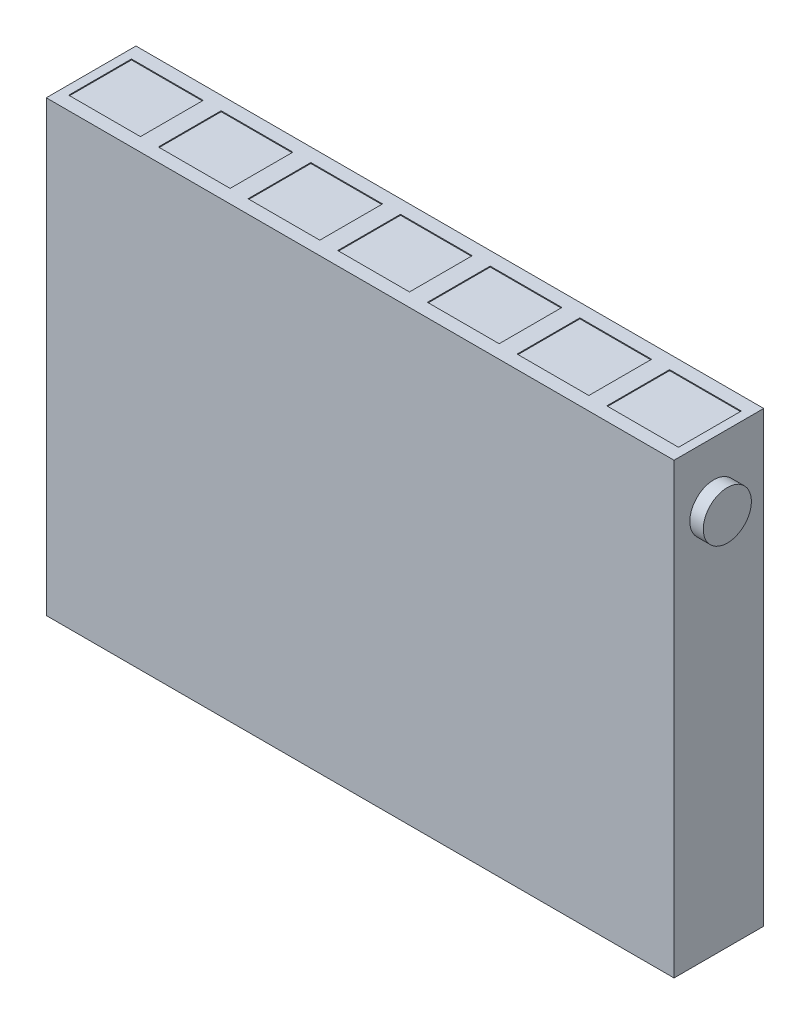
ISO-10303-21;
HEADER;
FILE_DESCRIPTION(('STEP AP214'),'2;1');
FILE_NAME('part.step','',(''),(''),'','','');
FILE_SCHEMA(('AUTOMOTIVE_DESIGN { 1 0 10303 214 1 1 1 1 }'));
ENDSEC;
DATA;
#1=APPLICATION_CONTEXT('core data for automotive mechanical design processes');
#2=APPLICATION_PROTOCOL_DEFINITION('international standard','automotive_design',2000,#1);
#3=PRODUCT_CONTEXT('',#1,'mechanical');
#4=PRODUCT('Part','Part','',(#3));
#5=PRODUCT_RELATED_PRODUCT_CATEGORY('part','',(#4));
#6=PRODUCT_DEFINITION_FORMATION('','',#4);
#7=PRODUCT_DEFINITION_CONTEXT('part definition',#1,'design');
#8=PRODUCT_DEFINITION('design','',#6,#7);
#9=PRODUCT_DEFINITION_SHAPE('','',#8);
#10=(LENGTH_UNIT() NAMED_UNIT(*) SI_UNIT(.MILLI.,.METRE.));
#11=(NAMED_UNIT(*) PLANE_ANGLE_UNIT() SI_UNIT($,.RADIAN.));
#12=(NAMED_UNIT(*) SI_UNIT($,.STERADIAN.) SOLID_ANGLE_UNIT());
#13=UNCERTAINTY_MEASURE_WITH_UNIT(LENGTH_MEASURE(1.E-05),#10,'distance_accuracy_value','');
#14=(GEOMETRIC_REPRESENTATION_CONTEXT(3) GLOBAL_UNCERTAINTY_ASSIGNED_CONTEXT((#13)) GLOBAL_UNIT_ASSIGNED_CONTEXT((#10,
#11,#12)) REPRESENTATION_CONTEXT('',''));
#15=CARTESIAN_POINT('',(0.,0.,0.));
#16=DIRECTION('',(0.,0.,1.));
#17=DIRECTION('',(1.,0.,0.));
#18=AXIS2_PLACEMENT_3D('',#15,#16,#17);
#19=CARTESIAN_POINT('',(-350.,-250.,100.));
#20=DIRECTION('',(1.,0.,0.));
#21=DIRECTION('',(0.,0.,-1.));
#22=AXIS2_PLACEMENT_3D('',#19,#20,#21);
#23=PLANE('',#22);
#24=DIRECTION('',(0.,-1.,0.));
#25=VECTOR('',#24,1.);
#26=CARTESIAN_POINT('',(-350.,-250.,0.));
#27=LINE('',#26,#25);
#28=CARTESIAN_POINT('',(-350.,250.,0.));
#29=VERTEX_POINT('',#28);
#30=CARTESIAN_POINT('',(-350.,-250.,0.));
#31=VERTEX_POINT('',#30);
#32=EDGE_CURVE('E474',#29,#31,#27,.T.);
#33=ORIENTED_EDGE('',*,*,#32,.T.);
#34=DIRECTION('',(0.,0.,-1.));
#35=VECTOR('',#34,1.);
#36=CARTESIAN_POINT('',(-350.,-250.,100.));
#37=LINE('',#36,#35);
#38=CARTESIAN_POINT('',(-350.,-250.,100.));
#39=VERTEX_POINT('',#38);
#40=EDGE_CURVE('E42',#39,#31,#37,.T.);
#41=ORIENTED_EDGE('',*,*,#40,.F.);
#42=DIRECTION('',(0.,-1.,0.));
#43=VECTOR('',#42,1.);
#44=CARTESIAN_POINT('',(-350.,-250.,100.));
#45=LINE('',#44,#43);
#46=CARTESIAN_POINT('',(-350.,250.,100.));
#47=VERTEX_POINT('',#46);
#48=EDGE_CURVE('E475',#47,#39,#45,.T.);
#49=ORIENTED_EDGE('',*,*,#48,.F.);
#50=DIRECTION('',(0.,0.,-1.));
#51=VECTOR('',#50,1.);
#52=CARTESIAN_POINT('',(-350.,250.,100.));
#53=LINE('',#52,#51);
#54=EDGE_CURVE('E485',#47,#29,#53,.T.);
#55=ORIENTED_EDGE('',*,*,#54,.T.);
#56=EDGE_LOOP('',(#33,#41,#49,#55));
#57=FACE_BOUND('',#56,.T.);
#58=ADVANCED_FACE('F35',(#57),#23,.F.);
#59=CARTESIAN_POINT('',(350.,-250.,100.));
#60=DIRECTION('',(0.,1.,0.));
#61=DIRECTION('',(-1.,0.,0.));
#62=AXIS2_PLACEMENT_3D('',#59,#60,#61);
#63=PLANE('',#62);
#64=DIRECTION('',(1.,0.,0.));
#65=VECTOR('',#64,1.);
#66=CARTESIAN_POINT('',(350.,-250.,0.));
#67=LINE('',#66,#65);
#68=CARTESIAN_POINT('',(350.,-250.,0.));
#69=VERTEX_POINT('',#68);
#70=EDGE_CURVE('E488',#31,#69,#67,.T.);
#71=ORIENTED_EDGE('',*,*,#70,.T.);
#72=DIRECTION('',(0.,0.,-1.));
#73=VECTOR('',#72,1.);
#74=CARTESIAN_POINT('',(350.,-250.,100.));
#75=LINE('',#74,#73);
#76=CARTESIAN_POINT('',(350.,-250.,100.));
#77=VERTEX_POINT('',#76);
#78=EDGE_CURVE('E498',#77,#69,#75,.T.);
#79=ORIENTED_EDGE('',*,*,#78,.F.);
#80=DIRECTION('',(1.,0.,0.));
#81=VECTOR('',#80,1.);
#82=CARTESIAN_POINT('',(350.,-250.,100.));
#83=LINE('',#82,#81);
#84=EDGE_CURVE('E478',#39,#77,#83,.T.);
#85=ORIENTED_EDGE('',*,*,#84,.F.);
#86=ORIENTED_EDGE('',*,*,#40,.T.);
#87=EDGE_LOOP('',(#71,#79,#85,#86));
#88=FACE_BOUND('',#87,.T.);
#89=ADVANCED_FACE('F503',(#88),#63,.F.);
#90=CARTESIAN_POINT('',(350.,-250.,100.));
#91=DIRECTION('',(-1.,0.,0.));
#92=DIRECTION('',(0.,0.,1.));
#93=AXIS2_PLACEMENT_3D('',#90,#91,#92);
#94=PLANE('',#93);
#95=CARTESIAN_POINT('',(350.,182.141362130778,55.5846904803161));
#96=DIRECTION('',(-1.,0.,0.));
#97=DIRECTION('',(0.,0.,1.));
#98=AXIS2_PLACEMENT_3D('',#95,#96,#97);
#99=CIRCLE('',#98,26.8213337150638);
#100=CARTESIAN_POINT('',(350.,182.141362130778,82.40602419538));
#101=VERTEX_POINT('',#100);
#102=EDGE_CURVE('E11',#101,#101,#99,.F.);
#103=ORIENTED_EDGE('',*,*,#102,.F.);
#104=EDGE_LOOP('',(#103));
#105=FACE_BOUND('',#104,.T.);
#106=DIRECTION('',(0.,1.,0.));
#107=VECTOR('',#106,1.);
#108=CARTESIAN_POINT('',(350.,-250.,0.));
#109=LINE('',#108,#107);
#110=CARTESIAN_POINT('',(350.,250.,0.));
#111=VERTEX_POINT('',#110);
#112=EDGE_CURVE('E490',#69,#111,#109,.T.);
#113=ORIENTED_EDGE('',*,*,#112,.T.);
#114=DIRECTION('',(0.,0.,-1.));
#115=VECTOR('',#114,1.);
#116=CARTESIAN_POINT('',(350.,250.,100.));
#117=LINE('',#116,#115);
#118=CARTESIAN_POINT('',(350.,250.,100.));
#119=VERTEX_POINT('',#118);
#120=EDGE_CURVE('E495',#119,#111,#117,.T.);
#121=ORIENTED_EDGE('',*,*,#120,.F.);
#122=DIRECTION('',(0.,1.,0.));
#123=VECTOR('',#122,1.);
#124=CARTESIAN_POINT('',(350.,-250.,100.));
#125=LINE('',#124,#123);
#126=EDGE_CURVE('E481',#77,#119,#125,.T.);
#127=ORIENTED_EDGE('',*,*,#126,.F.);
#128=ORIENTED_EDGE('',*,*,#78,.T.);
#129=EDGE_LOOP('',(#113,#121,#127,#128));
#130=FACE_BOUND('',#129,.T.);
#131=ADVANCED_FACE('F515',(#105,#130),#94,.F.);
#132=CARTESIAN_POINT('',(350.,250.,100.));
#133=DIRECTION('',(0.,-1.,0.));
#134=DIRECTION('',(1.,0.,0.));
#135=AXIS2_PLACEMENT_3D('',#132,#133,#134);
#136=PLANE('',#135);
#137=DIRECTION('',(1.,0.,0.));
#138=VECTOR('',#137,1.);
#139=CARTESIAN_POINT('',(260.,250.,85.));
#140=LINE('',#139,#138);
#141=CARTESIAN_POINT('',(260.,250.,85.));
#142=VERTEX_POINT('',#141);
#143=CARTESIAN_POINT('',(340.,250.,85.));
#144=VERTEX_POINT('',#143);
#145=EDGE_CURVE('E272',#142,#144,#140,.T.);
#146=ORIENTED_EDGE('',*,*,#145,.F.);
#147=DIRECTION('',(0.,0.,1.));
#148=VECTOR('',#147,1.);
#149=CARTESIAN_POINT('',(260.,250.,15.));
#150=LINE('',#149,#148);
#151=CARTESIAN_POINT('',(260.,250.,15.));
#152=VERTEX_POINT('',#151);
#153=EDGE_CURVE('E49',#152,#142,#150,.T.);
#154=ORIENTED_EDGE('',*,*,#153,.F.);
#155=DIRECTION('',(-1.,0.,0.));
#156=VECTOR('',#155,1.);
#157=CARTESIAN_POINT('',(260.,250.,15.));
#158=LINE('',#157,#156);
#159=CARTESIAN_POINT('',(340.,250.,15.));
#160=VERTEX_POINT('',#159);
#161=EDGE_CURVE('E263',#160,#152,#158,.T.);
#162=ORIENTED_EDGE('',*,*,#161,.F.);
#163=DIRECTION('',(0.,0.,-1.));
#164=VECTOR('',#163,1.);
#165=CARTESIAN_POINT('',(340.,250.,15.));
#166=LINE('',#165,#164);
#167=EDGE_CURVE('E266',#144,#160,#166,.T.);
#168=ORIENTED_EDGE('',*,*,#167,.F.);
#169=EDGE_LOOP('',(#146,#154,#162,#168));
#170=FACE_BOUND('',#169,.T.);
#171=DIRECTION('',(1.,0.,0.));
#172=VECTOR('',#171,1.);
#173=CARTESIAN_POINT('',(160.,250.,85.));
#174=LINE('',#173,#172);
#175=CARTESIAN_POINT('',(160.,250.,85.));
#176=VERTEX_POINT('',#175);
#177=CARTESIAN_POINT('',(240.,250.,85.));
#178=VERTEX_POINT('',#177);
#179=EDGE_CURVE('E296',#176,#178,#174,.T.);
#180=ORIENTED_EDGE('',*,*,#179,.F.);
#181=DIRECTION('',(0.,0.,1.));
#182=VECTOR('',#181,1.);
#183=CARTESIAN_POINT('',(160.,250.,15.));
#184=LINE('',#183,#182);
#185=CARTESIAN_POINT('',(160.,250.,15.));
#186=VERTEX_POINT('',#185);
#187=EDGE_CURVE('E57',#186,#176,#184,.T.);
#188=ORIENTED_EDGE('',*,*,#187,.F.);
#189=DIRECTION('',(-1.,0.,0.));
#190=VECTOR('',#189,1.);
#191=CARTESIAN_POINT('',(160.,250.,15.));
#192=LINE('',#191,#190);
#193=CARTESIAN_POINT('',(240.,250.,15.));
#194=VERTEX_POINT('',#193);
#195=EDGE_CURVE('E285',#194,#186,#192,.T.);
#196=ORIENTED_EDGE('',*,*,#195,.F.);
#197=DIRECTION('',(0.,0.,-1.));
#198=VECTOR('',#197,1.);
#199=CARTESIAN_POINT('',(240.,250.,15.));
#200=LINE('',#199,#198);
#201=EDGE_CURVE('E299',#178,#194,#200,.T.);
#202=ORIENTED_EDGE('',*,*,#201,.F.);
#203=EDGE_LOOP('',(#180,#188,#196,#202));
#204=FACE_BOUND('',#203,.T.);
#205=DIRECTION('',(1.,0.,0.));
#206=VECTOR('',#205,1.);
#207=CARTESIAN_POINT('',(60.,250.,85.));
#208=LINE('',#207,#206);
#209=CARTESIAN_POINT('',(59.9999999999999,250.,85.));
#210=VERTEX_POINT('',#209);
#211=CARTESIAN_POINT('',(140.,250.,85.));
#212=VERTEX_POINT('',#211);
#213=EDGE_CURVE('E327',#210,#212,#208,.T.);
#214=ORIENTED_EDGE('',*,*,#213,.F.);
#215=DIRECTION('',(0.,0.,1.));
#216=VECTOR('',#215,1.);
#217=CARTESIAN_POINT('',(60.,250.,15.));
#218=LINE('',#217,#216);
#219=CARTESIAN_POINT('',(60.,250.,15.));
#220=VERTEX_POINT('',#219);
#221=EDGE_CURVE('E306',#220,#210,#218,.T.);
#222=ORIENTED_EDGE('',*,*,#221,.F.);
#223=DIRECTION('',(-1.,0.,0.));
#224=VECTOR('',#223,1.);
#225=CARTESIAN_POINT('',(60.,250.,15.));
#226=LINE('',#225,#224);
#227=CARTESIAN_POINT('',(140.,250.,15.));
#228=VERTEX_POINT('',#227);
#229=EDGE_CURVE('E316',#228,#220,#226,.T.);
#230=ORIENTED_EDGE('',*,*,#229,.F.);
#231=DIRECTION('',(0.,0.,-1.));
#232=VECTOR('',#231,1.);
#233=CARTESIAN_POINT('',(140.,250.,15.));
#234=LINE('',#233,#232);
#235=EDGE_CURVE('E330',#212,#228,#234,.T.);
#236=ORIENTED_EDGE('',*,*,#235,.F.);
#237=EDGE_LOOP('',(#214,#222,#230,#236));
#238=FACE_BOUND('',#237,.T.);
#239=DIRECTION('',(1.,0.,0.));
#240=VECTOR('',#239,1.);
#241=CARTESIAN_POINT('',(-40.,250.,85.));
#242=LINE('',#241,#240);
#243=CARTESIAN_POINT('',(-40.,250.,85.));
#244=VERTEX_POINT('',#243);
#245=CARTESIAN_POINT('',(40.,250.,85.));
#246=VERTEX_POINT('',#245);
#247=EDGE_CURVE('E359',#244,#246,#242,.T.);
#248=ORIENTED_EDGE('',*,*,#247,.F.);
#249=DIRECTION('',(0.,0.,1.));
#250=VECTOR('',#249,1.);
#251=CARTESIAN_POINT('',(-40.,250.,15.));
#252=LINE('',#251,#250);
#253=CARTESIAN_POINT('',(-40.,250.,15.));
#254=VERTEX_POINT('',#253);
#255=EDGE_CURVE('E337',#254,#244,#252,.T.);
#256=ORIENTED_EDGE('',*,*,#255,.F.);
#257=DIRECTION('',(-1.,0.,0.));
#258=VECTOR('',#257,1.);
#259=CARTESIAN_POINT('',(-40.,250.,15.));
#260=LINE('',#259,#258);
#261=CARTESIAN_POINT('',(40.,250.,15.));
#262=VERTEX_POINT('',#261);
#263=EDGE_CURVE('E348',#262,#254,#260,.T.);
#264=ORIENTED_EDGE('',*,*,#263,.F.);
#265=DIRECTION('',(0.,0.,-1.));
#266=VECTOR('',#265,1.);
#267=CARTESIAN_POINT('',(40.,250.,15.));
#268=LINE('',#267,#266);
#269=EDGE_CURVE('E362',#246,#262,#268,.T.);
#270=ORIENTED_EDGE('',*,*,#269,.F.);
#271=EDGE_LOOP('',(#248,#256,#264,#270));
#272=FACE_BOUND('',#271,.T.);
#273=DIRECTION('',(1.,0.,0.));
#274=VECTOR('',#273,1.);
#275=CARTESIAN_POINT('',(-140.,250.,85.));
#276=LINE('',#275,#274);
#277=CARTESIAN_POINT('',(-140.,250.,85.));
#278=VERTEX_POINT('',#277);
#279=CARTESIAN_POINT('',(-60.,250.,85.));
#280=VERTEX_POINT('',#279);
#281=EDGE_CURVE('E391',#278,#280,#276,.T.);
#282=ORIENTED_EDGE('',*,*,#281,.F.);
#283=DIRECTION('',(0.,0.,1.));
#284=VECTOR('',#283,1.);
#285=CARTESIAN_POINT('',(-140.,250.,15.));
#286=LINE('',#285,#284);
#287=CARTESIAN_POINT('',(-140.,250.,15.));
#288=VERTEX_POINT('',#287);
#289=EDGE_CURVE('E369',#288,#278,#286,.T.);
#290=ORIENTED_EDGE('',*,*,#289,.F.);
#291=DIRECTION('',(-1.,0.,0.));
#292=VECTOR('',#291,1.);
#293=CARTESIAN_POINT('',(-140.,250.,15.));
#294=LINE('',#293,#292);
#295=CARTESIAN_POINT('',(-60.,250.,15.));
#296=VERTEX_POINT('',#295);
#297=EDGE_CURVE('E380',#296,#288,#294,.T.);
#298=ORIENTED_EDGE('',*,*,#297,.F.);
#299=DIRECTION('',(0.,0.,-1.));
#300=VECTOR('',#299,1.);
#301=CARTESIAN_POINT('',(-60.,250.,15.));
#302=LINE('',#301,#300);
#303=EDGE_CURVE('E394',#280,#296,#302,.T.);
#304=ORIENTED_EDGE('',*,*,#303,.F.);
#305=EDGE_LOOP('',(#282,#290,#298,#304));
#306=FACE_BOUND('',#305,.T.);
#307=DIRECTION('',(1.,0.,0.));
#308=VECTOR('',#307,1.);
#309=CARTESIAN_POINT('',(-240.,250.,85.));
#310=LINE('',#309,#308);
#311=CARTESIAN_POINT('',(-240.,250.,85.));
#312=VERTEX_POINT('',#311);
#313=CARTESIAN_POINT('',(-160.,250.,85.));
#314=VERTEX_POINT('',#313);
#315=EDGE_CURVE('E423',#312,#314,#310,.T.);
#316=ORIENTED_EDGE('',*,*,#315,.F.);
#317=DIRECTION('',(0.,0.,1.));
#318=VECTOR('',#317,1.);
#319=CARTESIAN_POINT('',(-240.,250.,15.));
#320=LINE('',#319,#318);
#321=CARTESIAN_POINT('',(-240.,250.,15.));
#322=VERTEX_POINT('',#321);
#323=EDGE_CURVE('E401',#322,#312,#320,.T.);
#324=ORIENTED_EDGE('',*,*,#323,.F.);
#325=DIRECTION('',(-1.,0.,0.));
#326=VECTOR('',#325,1.);
#327=CARTESIAN_POINT('',(-240.,250.,15.));
#328=LINE('',#327,#326);
#329=CARTESIAN_POINT('',(-160.,250.,15.));
#330=VERTEX_POINT('',#329);
#331=EDGE_CURVE('E412',#330,#322,#328,.T.);
#332=ORIENTED_EDGE('',*,*,#331,.F.);
#333=DIRECTION('',(0.,0.,-1.));
#334=VECTOR('',#333,1.);
#335=CARTESIAN_POINT('',(-160.,250.,15.));
#336=LINE('',#335,#334);
#337=EDGE_CURVE('E426',#314,#330,#336,.T.);
#338=ORIENTED_EDGE('',*,*,#337,.F.);
#339=EDGE_LOOP('',(#316,#324,#332,#338));
#340=FACE_BOUND('',#339,.T.);
#341=DIRECTION('',(1.,0.,0.));
#342=VECTOR('',#341,1.);
#343=CARTESIAN_POINT('',(-340.,250.,85.));
#344=LINE('',#343,#342);
#345=CARTESIAN_POINT('',(-340.,250.,85.));
#346=VERTEX_POINT('',#345);
#347=CARTESIAN_POINT('',(-260.,250.,85.));
#348=VERTEX_POINT('',#347);
#349=EDGE_CURVE('E455',#346,#348,#344,.T.);
#350=ORIENTED_EDGE('',*,*,#349,.F.);
#351=DIRECTION('',(0.,0.,1.));
#352=VECTOR('',#351,1.);
#353=CARTESIAN_POINT('',(-340.,250.,15.));
#354=LINE('',#353,#352);
#355=CARTESIAN_POINT('',(-340.,250.,15.));
#356=VERTEX_POINT('',#355);
#357=EDGE_CURVE('E433',#356,#346,#354,.T.);
#358=ORIENTED_EDGE('',*,*,#357,.F.);
#359=DIRECTION('',(-1.,0.,0.));
#360=VECTOR('',#359,1.);
#361=CARTESIAN_POINT('',(-340.,250.,15.));
#362=LINE('',#361,#360);
#363=CARTESIAN_POINT('',(-260.,250.,15.));
#364=VERTEX_POINT('',#363);
#365=EDGE_CURVE('E444',#364,#356,#362,.T.);
#366=ORIENTED_EDGE('',*,*,#365,.F.);
#367=DIRECTION('',(0.,0.,-1.));
#368=VECTOR('',#367,1.);
#369=CARTESIAN_POINT('',(-260.,250.,15.));
#370=LINE('',#369,#368);
#371=EDGE_CURVE('E458',#348,#364,#370,.T.);
#372=ORIENTED_EDGE('',*,*,#371,.F.);
#373=EDGE_LOOP('',(#350,#358,#366,#372));
#374=FACE_BOUND('',#373,.T.);
#375=DIRECTION('',(-1.,0.,0.));
#376=VECTOR('',#375,1.);
#377=CARTESIAN_POINT('',(350.,250.,0.));
#378=LINE('',#377,#376);
#379=EDGE_CURVE('E479',#111,#29,#378,.T.);
#380=ORIENTED_EDGE('',*,*,#379,.T.);
#381=ORIENTED_EDGE('',*,*,#54,.F.);
#382=DIRECTION('',(-1.,0.,0.));
#383=VECTOR('',#382,1.);
#384=CARTESIAN_POINT('',(350.,250.,100.));
#385=LINE('',#384,#383);
#386=EDGE_CURVE('E483',#119,#47,#385,.T.);
#387=ORIENTED_EDGE('',*,*,#386,.F.);
#388=ORIENTED_EDGE('',*,*,#120,.T.);
#389=EDGE_LOOP('',(#380,#381,#387,#388));
#390=FACE_BOUND('',#389,.T.);
#391=ADVANCED_FACE('F519',(#170,#204,#238,#272,#306,#340,#374,#390),#136,.F.);
#392=CARTESIAN_POINT('',(0.,0.,100.));
#393=DIRECTION('',(0.,0.,1.));
#394=DIRECTION('',(1.,0.,0.));
#395=AXIS2_PLACEMENT_3D('',#392,#393,#394);
#396=PLANE('',#395);
#397=ORIENTED_EDGE('',*,*,#48,.T.);
#398=ORIENTED_EDGE('',*,*,#84,.T.);
#399=ORIENTED_EDGE('',*,*,#126,.T.);
#400=ORIENTED_EDGE('',*,*,#386,.T.);
#401=EDGE_LOOP('',(#397,#398,#399,#400));
#402=FACE_BOUND('',#401,.T.);
#403=ADVANCED_FACE('F521',(#402),#396,.T.);
#404=CARTESIAN_POINT('',(0.,0.,0.));
#405=DIRECTION('',(0.,0.,1.));
#406=DIRECTION('',(1.,0.,0.));
#407=AXIS2_PLACEMENT_3D('',#404,#405,#406);
#408=PLANE('',#407);
#409=ORIENTED_EDGE('',*,*,#32,.F.);
#410=ORIENTED_EDGE('',*,*,#379,.F.);
#411=ORIENTED_EDGE('',*,*,#112,.F.);
#412=ORIENTED_EDGE('',*,*,#70,.F.);
#413=EDGE_LOOP('',(#409,#410,#411,#412));
#414=FACE_BOUND('',#413,.T.);
#415=ADVANCED_FACE('F511',(#414),#408,.F.);
#416=CARTESIAN_POINT('',(365.,182.141362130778,55.5846904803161));
#417=DIRECTION('',(-1.,0.,0.));
#418=DIRECTION('',(0.,0.,1.));
#419=AXIS2_PLACEMENT_3D('',#416,#417,#418);
#420=CYLINDRICAL_SURFACE('',#419,26.8213337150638);
#421=CARTESIAN_POINT('',(365.,182.141362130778,55.5846904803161));
#422=DIRECTION('',(1.,0.,0.));
#423=DIRECTION('',(0.,0.,-1.));
#424=AXIS2_PLACEMENT_3D('',#421,#422,#423);
#425=CIRCLE('',#424,26.8213337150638);
#426=CARTESIAN_POINT('',(365.,182.141362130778,28.7633567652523));
#427=VERTEX_POINT('',#426);
#428=EDGE_CURVE('E465',#427,#427,#425,.T.);
#429=ORIENTED_EDGE('',*,*,#428,.F.);
#430=EDGE_LOOP('',(#429));
#431=FACE_BOUND('',#430,.T.);
#432=ORIENTED_EDGE('',*,*,#102,.T.);
#433=EDGE_LOOP('',(#432));
#434=FACE_BOUND('',#433,.T.);
#435=ADVANCED_FACE('F528',(#431,#434),#420,.T.);
#436=CARTESIAN_POINT('',(365.,182.141362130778,55.5846904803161));
#437=DIRECTION('',(1.,0.,0.));
#438=DIRECTION('',(0.,0.,-1.));
#439=AXIS2_PLACEMENT_3D('',#436,#437,#438);
#440=PLANE('',#439);
#441=ORIENTED_EDGE('',*,*,#428,.T.);
#442=EDGE_LOOP('',(#441));
#443=FACE_BOUND('',#442,.T.);
#444=ADVANCED_FACE('F547',(#443),#440,.T.);
#445=CARTESIAN_POINT('',(-340.,249.,15.));
#446=DIRECTION('',(-1.,0.,0.));
#447=DIRECTION('',(0.,-1.,0.));
#448=AXIS2_PLACEMENT_3D('',#445,#446,#447);
#449=PLANE('',#448);
#450=ORIENTED_EDGE('',*,*,#357,.T.);
#451=DIRECTION('',(0.,1.,0.));
#452=VECTOR('',#451,1.);
#453=CARTESIAN_POINT('',(-340.,249.,85.));
#454=LINE('',#453,#452);
#455=CARTESIAN_POINT('',(-340.,249.,85.));
#456=VERTEX_POINT('',#455);
#457=EDGE_CURVE('E453',#456,#346,#454,.T.);
#458=ORIENTED_EDGE('',*,*,#457,.F.);
#459=DIRECTION('',(0.,0.,1.));
#460=VECTOR('',#459,1.);
#461=CARTESIAN_POINT('',(-340.,249.,15.));
#462=LINE('',#461,#460);
#463=CARTESIAN_POINT('',(-340.,249.,15.));
#464=VERTEX_POINT('',#463);
#465=EDGE_CURVE('E440',#464,#456,#462,.T.);
#466=ORIENTED_EDGE('',*,*,#465,.F.);
#467=DIRECTION('',(0.,1.,0.));
#468=VECTOR('',#467,1.);
#469=CARTESIAN_POINT('',(-340.,249.,15.));
#470=LINE('',#469,#468);
#471=EDGE_CURVE('E463',#464,#356,#470,.T.);
#472=ORIENTED_EDGE('',*,*,#471,.T.);
#473=EDGE_LOOP('',(#450,#458,#466,#472));
#474=FACE_BOUND('',#473,.T.);
#475=ADVANCED_FACE('F552',(#474),#449,.F.);
#476=CARTESIAN_POINT('',(-340.,249.,15.));
#477=DIRECTION('',(0.,0.,-1.));
#478=DIRECTION('',(-1.,0.,0.));
#479=AXIS2_PLACEMENT_3D('',#476,#477,#478);
#480=PLANE('',#479);
#481=ORIENTED_EDGE('',*,*,#365,.T.);
#482=ORIENTED_EDGE('',*,*,#471,.F.);
#483=DIRECTION('',(-1.,0.,0.));
#484=VECTOR('',#483,1.);
#485=CARTESIAN_POINT('',(-340.,249.,15.));
#486=LINE('',#485,#484);
#487=CARTESIAN_POINT('',(-260.,249.,15.));
#488=VERTEX_POINT('',#487);
#489=EDGE_CURVE('E450',#488,#464,#486,.T.);
#490=ORIENTED_EDGE('',*,*,#489,.F.);
#491=DIRECTION('',(0.,1.,0.));
#492=VECTOR('',#491,1.);
#493=CARTESIAN_POINT('',(-260.,249.,15.));
#494=LINE('',#493,#492);
#495=EDGE_CURVE('E466',#488,#364,#494,.T.);
#496=ORIENTED_EDGE('',*,*,#495,.T.);
#497=EDGE_LOOP('',(#481,#482,#490,#496));
#498=FACE_BOUND('',#497,.T.);
#499=ADVANCED_FACE('F559',(#498),#480,.F.);
#500=CARTESIAN_POINT('',(-260.,249.,15.));
#501=DIRECTION('',(1.,0.,0.));
#502=DIRECTION('',(0.,1.,0.));
#503=AXIS2_PLACEMENT_3D('',#500,#501,#502);
#504=PLANE('',#503);
#505=ORIENTED_EDGE('',*,*,#371,.T.);
#506=ORIENTED_EDGE('',*,*,#495,.F.);
#507=DIRECTION('',(0.,0.,-1.));
#508=VECTOR('',#507,1.);
#509=CARTESIAN_POINT('',(-260.,249.,15.));
#510=LINE('',#509,#508);
#511=CARTESIAN_POINT('',(-260.,249.,85.));
#512=VERTEX_POINT('',#511);
#513=EDGE_CURVE('E447',#512,#488,#510,.T.);
#514=ORIENTED_EDGE('',*,*,#513,.F.);
#515=DIRECTION('',(0.,1.,0.));
#516=VECTOR('',#515,1.);
#517=CARTESIAN_POINT('',(-260.,249.,85.));
#518=LINE('',#517,#516);
#519=EDGE_CURVE('E468',#512,#348,#518,.T.);
#520=ORIENTED_EDGE('',*,*,#519,.T.);
#521=EDGE_LOOP('',(#505,#506,#514,#520));
#522=FACE_BOUND('',#521,.T.);
#523=ADVANCED_FACE('F565',(#522),#504,.F.);
#524=CARTESIAN_POINT('',(-340.,249.,85.));
#525=DIRECTION('',(0.,0.,1.));
#526=DIRECTION('',(1.,0.,0.));
#527=AXIS2_PLACEMENT_3D('',#524,#525,#526);
#528=PLANE('',#527);
#529=ORIENTED_EDGE('',*,*,#349,.T.);
#530=ORIENTED_EDGE('',*,*,#519,.F.);
#531=DIRECTION('',(1.,0.,0.));
#532=VECTOR('',#531,1.);
#533=CARTESIAN_POINT('',(-340.,249.,85.));
#534=LINE('',#533,#532);
#535=EDGE_CURVE('E443',#456,#512,#534,.T.);
#536=ORIENTED_EDGE('',*,*,#535,.F.);
#537=ORIENTED_EDGE('',*,*,#457,.T.);
#538=EDGE_LOOP('',(#529,#530,#536,#537));
#539=FACE_BOUND('',#538,.T.);
#540=ADVANCED_FACE('F561',(#539),#528,.F.);
#541=CARTESIAN_POINT('',(0.,249.,0.));
#542=DIRECTION('',(0.,1.,0.));
#543=DIRECTION('',(-1.,0.,0.));
#544=AXIS2_PLACEMENT_3D('',#541,#542,#543);
#545=PLANE('',#544);
#546=ORIENTED_EDGE('',*,*,#465,.T.);
#547=ORIENTED_EDGE('',*,*,#535,.T.);
#548=ORIENTED_EDGE('',*,*,#513,.T.);
#549=ORIENTED_EDGE('',*,*,#489,.T.);
#550=EDGE_LOOP('',(#546,#547,#548,#549));
#551=FACE_BOUND('',#550,.T.);
#552=ADVANCED_FACE('F564',(#551),#545,.T.);
#553=CARTESIAN_POINT('',(-240.,249.,15.));
#554=DIRECTION('',(-1.,0.,0.));
#555=DIRECTION('',(0.,-1.,0.));
#556=AXIS2_PLACEMENT_3D('',#553,#554,#555);
#557=PLANE('',#556);
#558=ORIENTED_EDGE('',*,*,#323,.T.);
#559=DIRECTION('',(0.,1.,0.));
#560=VECTOR('',#559,1.);
#561=CARTESIAN_POINT('',(-240.,249.,85.));
#562=LINE('',#561,#560);
#563=CARTESIAN_POINT('',(-240.,249.,85.));
#564=VERTEX_POINT('',#563);
#565=EDGE_CURVE('E421',#564,#312,#562,.T.);
#566=ORIENTED_EDGE('',*,*,#565,.F.);
#567=DIRECTION('',(0.,0.,1.));
#568=VECTOR('',#567,1.);
#569=CARTESIAN_POINT('',(-240.,249.,15.));
#570=LINE('',#569,#568);
#571=CARTESIAN_POINT('',(-240.,249.,15.));
#572=VERTEX_POINT('',#571);
#573=EDGE_CURVE('E408',#572,#564,#570,.T.);
#574=ORIENTED_EDGE('',*,*,#573,.F.);
#575=DIRECTION('',(0.,1.,0.));
#576=VECTOR('',#575,1.);
#577=CARTESIAN_POINT('',(-240.,249.,15.));
#578=LINE('',#577,#576);
#579=EDGE_CURVE('E431',#572,#322,#578,.T.);
#580=ORIENTED_EDGE('',*,*,#579,.T.);
#581=EDGE_LOOP('',(#558,#566,#574,#580));
#582=FACE_BOUND('',#581,.T.);
#583=ADVANCED_FACE('F575',(#582),#557,.F.);
#584=CARTESIAN_POINT('',(-240.,249.,15.));
#585=DIRECTION('',(0.,0.,-1.));
#586=DIRECTION('',(-1.,0.,0.));
#587=AXIS2_PLACEMENT_3D('',#584,#585,#586);
#588=PLANE('',#587);
#589=ORIENTED_EDGE('',*,*,#331,.T.);
#590=ORIENTED_EDGE('',*,*,#579,.F.);
#591=DIRECTION('',(-1.,0.,0.));
#592=VECTOR('',#591,1.);
#593=CARTESIAN_POINT('',(-240.,249.,15.));
#594=LINE('',#593,#592);
#595=CARTESIAN_POINT('',(-160.,249.,15.));
#596=VERTEX_POINT('',#595);
#597=EDGE_CURVE('E418',#596,#572,#594,.T.);
#598=ORIENTED_EDGE('',*,*,#597,.F.);
#599=DIRECTION('',(0.,1.,0.));
#600=VECTOR('',#599,1.);
#601=CARTESIAN_POINT('',(-160.,249.,15.));
#602=LINE('',#601,#600);
#603=EDGE_CURVE('E434',#596,#330,#602,.T.);
#604=ORIENTED_EDGE('',*,*,#603,.T.);
#605=EDGE_LOOP('',(#589,#590,#598,#604));
#606=FACE_BOUND('',#605,.T.);
#607=ADVANCED_FACE('F579',(#606),#588,.F.);
#608=CARTESIAN_POINT('',(-160.,249.,15.));
#609=DIRECTION('',(1.,0.,0.));
#610=DIRECTION('',(0.,1.,0.));
#611=AXIS2_PLACEMENT_3D('',#608,#609,#610);
#612=PLANE('',#611);
#613=ORIENTED_EDGE('',*,*,#337,.T.);
#614=ORIENTED_EDGE('',*,*,#603,.F.);
#615=DIRECTION('',(0.,0.,-1.));
#616=VECTOR('',#615,1.);
#617=CARTESIAN_POINT('',(-160.,249.,15.));
#618=LINE('',#617,#616);
#619=CARTESIAN_POINT('',(-160.,249.,85.));
#620=VERTEX_POINT('',#619);
#621=EDGE_CURVE('E415',#620,#596,#618,.T.);
#622=ORIENTED_EDGE('',*,*,#621,.F.);
#623=DIRECTION('',(0.,1.,0.));
#624=VECTOR('',#623,1.);
#625=CARTESIAN_POINT('',(-160.,249.,85.));
#626=LINE('',#625,#624);
#627=EDGE_CURVE('E436',#620,#314,#626,.T.);
#628=ORIENTED_EDGE('',*,*,#627,.T.);
#629=EDGE_LOOP('',(#613,#614,#622,#628));
#630=FACE_BOUND('',#629,.T.);
#631=ADVANCED_FACE('F585',(#630),#612,.F.);
#632=CARTESIAN_POINT('',(-240.,249.,85.));
#633=DIRECTION('',(0.,0.,1.));
#634=DIRECTION('',(1.,0.,0.));
#635=AXIS2_PLACEMENT_3D('',#632,#633,#634);
#636=PLANE('',#635);
#637=ORIENTED_EDGE('',*,*,#315,.T.);
#638=ORIENTED_EDGE('',*,*,#627,.F.);
#639=DIRECTION('',(1.,0.,0.));
#640=VECTOR('',#639,1.);
#641=CARTESIAN_POINT('',(-240.,249.,85.));
#642=LINE('',#641,#640);
#643=EDGE_CURVE('E411',#564,#620,#642,.T.);
#644=ORIENTED_EDGE('',*,*,#643,.F.);
#645=ORIENTED_EDGE('',*,*,#565,.T.);
#646=EDGE_LOOP('',(#637,#638,#644,#645));
#647=FACE_BOUND('',#646,.T.);
#648=ADVANCED_FACE('F581',(#647),#636,.F.);
#649=CARTESIAN_POINT('',(0.,249.,0.));
#650=DIRECTION('',(0.,1.,0.));
#651=DIRECTION('',(0.,0.,1.));
#652=AXIS2_PLACEMENT_3D('',#649,#650,#651);
#653=PLANE('',#652);
#654=ORIENTED_EDGE('',*,*,#573,.T.);
#655=ORIENTED_EDGE('',*,*,#643,.T.);
#656=ORIENTED_EDGE('',*,*,#621,.T.);
#657=ORIENTED_EDGE('',*,*,#597,.T.);
#658=EDGE_LOOP('',(#654,#655,#656,#657));
#659=FACE_BOUND('',#658,.T.);
#660=ADVANCED_FACE('F584',(#659),#653,.T.);
#661=CARTESIAN_POINT('',(-140.,249.,15.));
#662=DIRECTION('',(-1.,0.,0.));
#663=DIRECTION('',(0.,-1.,0.));
#664=AXIS2_PLACEMENT_3D('',#661,#662,#663);
#665=PLANE('',#664);
#666=ORIENTED_EDGE('',*,*,#289,.T.);
#667=DIRECTION('',(0.,1.,0.));
#668=VECTOR('',#667,1.);
#669=CARTESIAN_POINT('',(-140.,249.,85.));
#670=LINE('',#669,#668);
#671=CARTESIAN_POINT('',(-140.,249.,85.));
#672=VERTEX_POINT('',#671);
#673=EDGE_CURVE('E389',#672,#278,#670,.T.);
#674=ORIENTED_EDGE('',*,*,#673,.F.);
#675=DIRECTION('',(0.,0.,1.));
#676=VECTOR('',#675,1.);
#677=CARTESIAN_POINT('',(-140.,249.,15.));
#678=LINE('',#677,#676);
#679=CARTESIAN_POINT('',(-140.,249.,15.));
#680=VERTEX_POINT('',#679);
#681=EDGE_CURVE('E376',#680,#672,#678,.T.);
#682=ORIENTED_EDGE('',*,*,#681,.F.);
#683=DIRECTION('',(0.,1.,0.));
#684=VECTOR('',#683,1.);
#685=CARTESIAN_POINT('',(-140.,249.,15.));
#686=LINE('',#685,#684);
#687=EDGE_CURVE('E399',#680,#288,#686,.T.);
#688=ORIENTED_EDGE('',*,*,#687,.T.);
#689=EDGE_LOOP('',(#666,#674,#682,#688));
#690=FACE_BOUND('',#689,.T.);
#691=ADVANCED_FACE('F595',(#690),#665,.F.);
#692=CARTESIAN_POINT('',(-140.,249.,15.));
#693=DIRECTION('',(0.,0.,-1.));
#694=DIRECTION('',(-1.,0.,0.));
#695=AXIS2_PLACEMENT_3D('',#692,#693,#694);
#696=PLANE('',#695);
#697=ORIENTED_EDGE('',*,*,#297,.T.);
#698=ORIENTED_EDGE('',*,*,#687,.F.);
#699=DIRECTION('',(-1.,0.,0.));
#700=VECTOR('',#699,1.);
#701=CARTESIAN_POINT('',(-140.,249.,15.));
#702=LINE('',#701,#700);
#703=CARTESIAN_POINT('',(-60.,249.,15.));
#704=VERTEX_POINT('',#703);
#705=EDGE_CURVE('E386',#704,#680,#702,.T.);
#706=ORIENTED_EDGE('',*,*,#705,.F.);
#707=DIRECTION('',(0.,1.,0.));
#708=VECTOR('',#707,1.);
#709=CARTESIAN_POINT('',(-60.,249.,15.));
#710=LINE('',#709,#708);
#711=EDGE_CURVE('E402',#704,#296,#710,.T.);
#712=ORIENTED_EDGE('',*,*,#711,.T.);
#713=EDGE_LOOP('',(#697,#698,#706,#712));
#714=FACE_BOUND('',#713,.T.);
#715=ADVANCED_FACE('F599',(#714),#696,.F.);
#716=CARTESIAN_POINT('',(-60.,249.,15.));
#717=DIRECTION('',(1.,0.,0.));
#718=DIRECTION('',(0.,1.,0.));
#719=AXIS2_PLACEMENT_3D('',#716,#717,#718);
#720=PLANE('',#719);
#721=ORIENTED_EDGE('',*,*,#303,.T.);
#722=ORIENTED_EDGE('',*,*,#711,.F.);
#723=DIRECTION('',(0.,0.,-1.));
#724=VECTOR('',#723,1.);
#725=CARTESIAN_POINT('',(-60.,249.,15.));
#726=LINE('',#725,#724);
#727=CARTESIAN_POINT('',(-60.,249.,85.));
#728=VERTEX_POINT('',#727);
#729=EDGE_CURVE('E383',#728,#704,#726,.T.);
#730=ORIENTED_EDGE('',*,*,#729,.F.);
#731=DIRECTION('',(0.,1.,0.));
#732=VECTOR('',#731,1.);
#733=CARTESIAN_POINT('',(-60.,249.,85.));
#734=LINE('',#733,#732);
#735=EDGE_CURVE('E404',#728,#280,#734,.T.);
#736=ORIENTED_EDGE('',*,*,#735,.T.);
#737=EDGE_LOOP('',(#721,#722,#730,#736));
#738=FACE_BOUND('',#737,.T.);
#739=ADVANCED_FACE('F605',(#738),#720,.F.);
#740=CARTESIAN_POINT('',(-140.,249.,85.));
#741=DIRECTION('',(0.,0.,1.));
#742=DIRECTION('',(1.,0.,0.));
#743=AXIS2_PLACEMENT_3D('',#740,#741,#742);
#744=PLANE('',#743);
#745=ORIENTED_EDGE('',*,*,#281,.T.);
#746=ORIENTED_EDGE('',*,*,#735,.F.);
#747=DIRECTION('',(1.,0.,0.));
#748=VECTOR('',#747,1.);
#749=CARTESIAN_POINT('',(-140.,249.,85.));
#750=LINE('',#749,#748);
#751=EDGE_CURVE('E379',#672,#728,#750,.T.);
#752=ORIENTED_EDGE('',*,*,#751,.F.);
#753=ORIENTED_EDGE('',*,*,#673,.T.);
#754=EDGE_LOOP('',(#745,#746,#752,#753));
#755=FACE_BOUND('',#754,.T.);
#756=ADVANCED_FACE('F601',(#755),#744,.F.);
#757=CARTESIAN_POINT('',(0.,249.,0.));
#758=DIRECTION('',(0.,1.,0.));
#759=DIRECTION('',(-1.,0.,0.));
#760=AXIS2_PLACEMENT_3D('',#757,#758,#759);
#761=PLANE('',#760);
#762=ORIENTED_EDGE('',*,*,#681,.T.);
#763=ORIENTED_EDGE('',*,*,#751,.T.);
#764=ORIENTED_EDGE('',*,*,#729,.T.);
#765=ORIENTED_EDGE('',*,*,#705,.T.);
#766=EDGE_LOOP('',(#762,#763,#764,#765));
#767=FACE_BOUND('',#766,.T.);
#768=ADVANCED_FACE('F604',(#767),#761,.T.);
#769=CARTESIAN_POINT('',(-40.,249.,15.));
#770=DIRECTION('',(-1.,0.,0.));
#771=DIRECTION('',(0.,-1.,0.));
#772=AXIS2_PLACEMENT_3D('',#769,#770,#771);
#773=PLANE('',#772);
#774=ORIENTED_EDGE('',*,*,#255,.T.);
#775=DIRECTION('',(0.,1.,0.));
#776=VECTOR('',#775,1.);
#777=CARTESIAN_POINT('',(-40.,249.,85.));
#778=LINE('',#777,#776);
#779=CARTESIAN_POINT('',(-40.,249.,85.));
#780=VERTEX_POINT('',#779);
#781=EDGE_CURVE('E357',#780,#244,#778,.T.);
#782=ORIENTED_EDGE('',*,*,#781,.F.);
#783=DIRECTION('',(0.,0.,1.));
#784=VECTOR('',#783,1.);
#785=CARTESIAN_POINT('',(-40.,249.,15.));
#786=LINE('',#785,#784);
#787=CARTESIAN_POINT('',(-40.,249.,15.));
#788=VERTEX_POINT('',#787);
#789=EDGE_CURVE('E344',#788,#780,#786,.T.);
#790=ORIENTED_EDGE('',*,*,#789,.F.);
#791=DIRECTION('',(0.,1.,0.));
#792=VECTOR('',#791,1.);
#793=CARTESIAN_POINT('',(-40.,249.,15.));
#794=LINE('',#793,#792);
#795=EDGE_CURVE('E367',#788,#254,#794,.T.);
#796=ORIENTED_EDGE('',*,*,#795,.T.);
#797=EDGE_LOOP('',(#774,#782,#790,#796));
#798=FACE_BOUND('',#797,.T.);
#799=ADVANCED_FACE('F615',(#798),#773,.F.);
#800=CARTESIAN_POINT('',(-40.,249.,15.));
#801=DIRECTION('',(0.,0.,-1.));
#802=DIRECTION('',(-1.,0.,0.));
#803=AXIS2_PLACEMENT_3D('',#800,#801,#802);
#804=PLANE('',#803);
#805=ORIENTED_EDGE('',*,*,#263,.T.);
#806=ORIENTED_EDGE('',*,*,#795,.F.);
#807=DIRECTION('',(-1.,0.,0.));
#808=VECTOR('',#807,1.);
#809=CARTESIAN_POINT('',(-40.,249.,15.));
#810=LINE('',#809,#808);
#811=CARTESIAN_POINT('',(40.,249.,15.));
#812=VERTEX_POINT('',#811);
#813=EDGE_CURVE('E354',#812,#788,#810,.T.);
#814=ORIENTED_EDGE('',*,*,#813,.F.);
#815=DIRECTION('',(0.,1.,0.));
#816=VECTOR('',#815,1.);
#817=CARTESIAN_POINT('',(40.,249.,15.));
#818=LINE('',#817,#816);
#819=EDGE_CURVE('E370',#812,#262,#818,.T.);
#820=ORIENTED_EDGE('',*,*,#819,.T.);
#821=EDGE_LOOP('',(#805,#806,#814,#820));
#822=FACE_BOUND('',#821,.T.);
#823=ADVANCED_FACE('F619',(#822),#804,.F.);
#824=CARTESIAN_POINT('',(40.,249.,15.));
#825=DIRECTION('',(1.,0.,0.));
#826=DIRECTION('',(0.,1.,0.));
#827=AXIS2_PLACEMENT_3D('',#824,#825,#826);
#828=PLANE('',#827);
#829=ORIENTED_EDGE('',*,*,#269,.T.);
#830=ORIENTED_EDGE('',*,*,#819,.F.);
#831=DIRECTION('',(0.,0.,-1.));
#832=VECTOR('',#831,1.);
#833=CARTESIAN_POINT('',(40.,249.,15.));
#834=LINE('',#833,#832);
#835=CARTESIAN_POINT('',(40.,249.,85.));
#836=VERTEX_POINT('',#835);
#837=EDGE_CURVE('E351',#836,#812,#834,.T.);
#838=ORIENTED_EDGE('',*,*,#837,.F.);
#839=DIRECTION('',(0.,1.,0.));
#840=VECTOR('',#839,1.);
#841=CARTESIAN_POINT('',(40.,249.,85.));
#842=LINE('',#841,#840);
#843=EDGE_CURVE('E372',#836,#246,#842,.T.);
#844=ORIENTED_EDGE('',*,*,#843,.T.);
#845=EDGE_LOOP('',(#829,#830,#838,#844));
#846=FACE_BOUND('',#845,.T.);
#847=ADVANCED_FACE('F625',(#846),#828,.F.);
#848=CARTESIAN_POINT('',(-40.,249.,85.));
#849=DIRECTION('',(0.,0.,1.));
#850=DIRECTION('',(1.,0.,0.));
#851=AXIS2_PLACEMENT_3D('',#848,#849,#850);
#852=PLANE('',#851);
#853=ORIENTED_EDGE('',*,*,#247,.T.);
#854=ORIENTED_EDGE('',*,*,#843,.F.);
#855=DIRECTION('',(1.,0.,0.));
#856=VECTOR('',#855,1.);
#857=CARTESIAN_POINT('',(-40.,249.,85.));
#858=LINE('',#857,#856);
#859=EDGE_CURVE('E347',#780,#836,#858,.T.);
#860=ORIENTED_EDGE('',*,*,#859,.F.);
#861=ORIENTED_EDGE('',*,*,#781,.T.);
#862=EDGE_LOOP('',(#853,#854,#860,#861));
#863=FACE_BOUND('',#862,.T.);
#864=ADVANCED_FACE('F621',(#863),#852,.F.);
#865=CARTESIAN_POINT('',(0.,249.,0.));
#866=DIRECTION('',(0.,1.,0.));
#867=DIRECTION('',(0.,0.,1.));
#868=AXIS2_PLACEMENT_3D('',#865,#866,#867);
#869=PLANE('',#868);
#870=ORIENTED_EDGE('',*,*,#789,.T.);
#871=ORIENTED_EDGE('',*,*,#859,.T.);
#872=ORIENTED_EDGE('',*,*,#837,.T.);
#873=ORIENTED_EDGE('',*,*,#813,.T.);
#874=EDGE_LOOP('',(#870,#871,#872,#873));
#875=FACE_BOUND('',#874,.T.);
#876=ADVANCED_FACE('F624',(#875),#869,.T.);
#877=CARTESIAN_POINT('',(60.,249.,15.));
#878=DIRECTION('',(-1.,0.,0.));
#879=DIRECTION('',(0.,-1.,0.));
#880=AXIS2_PLACEMENT_3D('',#877,#878,#879);
#881=PLANE('',#880);
#882=ORIENTED_EDGE('',*,*,#221,.T.);
#883=DIRECTION('',(0.,1.,0.));
#884=VECTOR('',#883,1.);
#885=CARTESIAN_POINT('',(60.,249.,85.));
#886=LINE('',#885,#884);
#887=CARTESIAN_POINT('',(60.,249.,85.));
#888=VERTEX_POINT('',#887);
#889=EDGE_CURVE('E325',#888,#210,#886,.T.);
#890=ORIENTED_EDGE('',*,*,#889,.F.);
#891=DIRECTION('',(0.,0.,1.));
#892=VECTOR('',#891,1.);
#893=CARTESIAN_POINT('',(60.,249.,15.));
#894=LINE('',#893,#892);
#895=CARTESIAN_POINT('',(60.,249.,15.));
#896=VERTEX_POINT('',#895);
#897=EDGE_CURVE('E312',#896,#888,#894,.T.);
#898=ORIENTED_EDGE('',*,*,#897,.F.);
#899=DIRECTION('',(0.,1.,0.));
#900=VECTOR('',#899,1.);
#901=CARTESIAN_POINT('',(60.,249.,15.));
#902=LINE('',#901,#900);
#903=EDGE_CURVE('E335',#896,#220,#902,.T.);
#904=ORIENTED_EDGE('',*,*,#903,.T.);
#905=EDGE_LOOP('',(#882,#890,#898,#904));
#906=FACE_BOUND('',#905,.T.);
#907=ADVANCED_FACE('F635',(#906),#881,.F.);
#908=CARTESIAN_POINT('',(60.,249.,15.));
#909=DIRECTION('',(0.,0.,-1.));
#910=DIRECTION('',(-1.,0.,0.));
#911=AXIS2_PLACEMENT_3D('',#908,#909,#910);
#912=PLANE('',#911);
#913=ORIENTED_EDGE('',*,*,#229,.T.);
#914=ORIENTED_EDGE('',*,*,#903,.F.);
#915=DIRECTION('',(-1.,0.,0.));
#916=VECTOR('',#915,1.);
#917=CARTESIAN_POINT('',(60.,249.,15.));
#918=LINE('',#917,#916);
#919=CARTESIAN_POINT('',(140.,249.,15.));
#920=VERTEX_POINT('',#919);
#921=EDGE_CURVE('E322',#920,#896,#918,.T.);
#922=ORIENTED_EDGE('',*,*,#921,.F.);
#923=DIRECTION('',(0.,1.,0.));
#924=VECTOR('',#923,1.);
#925=CARTESIAN_POINT('',(140.,249.,15.));
#926=LINE('',#925,#924);
#927=EDGE_CURVE('E338',#920,#228,#926,.T.);
#928=ORIENTED_EDGE('',*,*,#927,.T.);
#929=EDGE_LOOP('',(#913,#914,#922,#928));
#930=FACE_BOUND('',#929,.T.);
#931=ADVANCED_FACE('F639',(#930),#912,.F.);
#932=CARTESIAN_POINT('',(140.,249.,15.));
#933=DIRECTION('',(1.,0.,0.));
#934=DIRECTION('',(0.,1.,0.));
#935=AXIS2_PLACEMENT_3D('',#932,#933,#934);
#936=PLANE('',#935);
#937=ORIENTED_EDGE('',*,*,#235,.T.);
#938=ORIENTED_EDGE('',*,*,#927,.F.);
#939=DIRECTION('',(0.,0.,-1.));
#940=VECTOR('',#939,1.);
#941=CARTESIAN_POINT('',(140.,249.,15.));
#942=LINE('',#941,#940);
#943=CARTESIAN_POINT('',(140.,249.,85.));
#944=VERTEX_POINT('',#943);
#945=EDGE_CURVE('E319',#944,#920,#942,.T.);
#946=ORIENTED_EDGE('',*,*,#945,.F.);
#947=DIRECTION('',(0.,1.,0.));
#948=VECTOR('',#947,1.);
#949=CARTESIAN_POINT('',(140.,249.,85.));
#950=LINE('',#949,#948);
#951=EDGE_CURVE('E340',#944,#212,#950,.T.);
#952=ORIENTED_EDGE('',*,*,#951,.T.);
#953=EDGE_LOOP('',(#937,#938,#946,#952));
#954=FACE_BOUND('',#953,.T.);
#955=ADVANCED_FACE('F645',(#954),#936,.F.);
#956=CARTESIAN_POINT('',(60.,249.,85.));
#957=DIRECTION('',(0.,0.,1.));
#958=DIRECTION('',(1.,0.,0.));
#959=AXIS2_PLACEMENT_3D('',#956,#957,#958);
#960=PLANE('',#959);
#961=ORIENTED_EDGE('',*,*,#213,.T.);
#962=ORIENTED_EDGE('',*,*,#951,.F.);
#963=DIRECTION('',(1.,0.,0.));
#964=VECTOR('',#963,1.);
#965=CARTESIAN_POINT('',(60.,249.,85.));
#966=LINE('',#965,#964);
#967=EDGE_CURVE('E315',#888,#944,#966,.T.);
#968=ORIENTED_EDGE('',*,*,#967,.F.);
#969=ORIENTED_EDGE('',*,*,#889,.T.);
#970=EDGE_LOOP('',(#961,#962,#968,#969));
#971=FACE_BOUND('',#970,.T.);
#972=ADVANCED_FACE('F641',(#971),#960,.F.);
#973=CARTESIAN_POINT('',(0.,249.,0.));
#974=DIRECTION('',(0.,1.,0.));
#975=DIRECTION('',(0.,0.,1.));
#976=AXIS2_PLACEMENT_3D('',#973,#974,#975);
#977=PLANE('',#976);
#978=ORIENTED_EDGE('',*,*,#897,.T.);
#979=ORIENTED_EDGE('',*,*,#967,.T.);
#980=ORIENTED_EDGE('',*,*,#945,.T.);
#981=ORIENTED_EDGE('',*,*,#921,.T.);
#982=EDGE_LOOP('',(#978,#979,#980,#981));
#983=FACE_BOUND('',#982,.T.);
#984=ADVANCED_FACE('F644',(#983),#977,.T.);
#985=CARTESIAN_POINT('',(160.,249.,15.));
#986=DIRECTION('',(-1.,0.,0.));
#987=DIRECTION('',(0.,-1.,0.));
#988=AXIS2_PLACEMENT_3D('',#985,#986,#987);
#989=PLANE('',#988);
#990=ORIENTED_EDGE('',*,*,#187,.T.);
#991=DIRECTION('',(0.,1.,0.));
#992=VECTOR('',#991,1.);
#993=CARTESIAN_POINT('',(160.,249.,85.));
#994=LINE('',#993,#992);
#995=CARTESIAN_POINT('',(160.,249.,85.));
#996=VERTEX_POINT('',#995);
#997=EDGE_CURVE('E294',#996,#176,#994,.T.);
#998=ORIENTED_EDGE('',*,*,#997,.F.);
#999=DIRECTION('',(0.,0.,1.));
#1000=VECTOR('',#999,1.);
#1001=CARTESIAN_POINT('',(160.,249.,15.));
#1002=LINE('',#1001,#1000);
#1003=CARTESIAN_POINT('',(160.,249.,15.));
#1004=VERTEX_POINT('',#1003);
#1005=EDGE_CURVE('E281',#1004,#996,#1002,.T.);
#1006=ORIENTED_EDGE('',*,*,#1005,.F.);
#1007=DIRECTION('',(0.,1.,0.));
#1008=VECTOR('',#1007,1.);
#1009=CARTESIAN_POINT('',(160.,249.,15.));
#1010=LINE('',#1009,#1008);
#1011=EDGE_CURVE('E304',#1004,#186,#1010,.T.);
#1012=ORIENTED_EDGE('',*,*,#1011,.T.);
#1013=EDGE_LOOP('',(#990,#998,#1006,#1012));
#1014=FACE_BOUND('',#1013,.T.);
#1015=ADVANCED_FACE('F655',(#1014),#989,.F.);
#1016=CARTESIAN_POINT('',(160.,249.,15.));
#1017=DIRECTION('',(0.,0.,-1.));
#1018=DIRECTION('',(-1.,0.,0.));
#1019=AXIS2_PLACEMENT_3D('',#1016,#1017,#1018);
#1020=PLANE('',#1019);
#1021=ORIENTED_EDGE('',*,*,#195,.T.);
#1022=ORIENTED_EDGE('',*,*,#1011,.F.);
#1023=DIRECTION('',(-1.,0.,0.));
#1024=VECTOR('',#1023,1.);
#1025=CARTESIAN_POINT('',(160.,249.,15.));
#1026=LINE('',#1025,#1024);
#1027=CARTESIAN_POINT('',(240.,249.,15.));
#1028=VERTEX_POINT('',#1027);
#1029=EDGE_CURVE('E291',#1028,#1004,#1026,.T.);
#1030=ORIENTED_EDGE('',*,*,#1029,.F.);
#1031=DIRECTION('',(0.,1.,0.));
#1032=VECTOR('',#1031,1.);
#1033=CARTESIAN_POINT('',(240.,249.,15.));
#1034=LINE('',#1033,#1032);
#1035=EDGE_CURVE('E307',#1028,#194,#1034,.T.);
#1036=ORIENTED_EDGE('',*,*,#1035,.T.);
#1037=EDGE_LOOP('',(#1021,#1022,#1030,#1036));
#1038=FACE_BOUND('',#1037,.T.);
#1039=ADVANCED_FACE('F659',(#1038),#1020,.F.);
#1040=CARTESIAN_POINT('',(240.,249.,15.));
#1041=DIRECTION('',(1.,0.,0.));
#1042=DIRECTION('',(0.,1.,0.));
#1043=AXIS2_PLACEMENT_3D('',#1040,#1041,#1042);
#1044=PLANE('',#1043);
#1045=ORIENTED_EDGE('',*,*,#201,.T.);
#1046=ORIENTED_EDGE('',*,*,#1035,.F.);
#1047=DIRECTION('',(0.,0.,-1.));
#1048=VECTOR('',#1047,1.);
#1049=CARTESIAN_POINT('',(240.,249.,15.));
#1050=LINE('',#1049,#1048);
#1051=CARTESIAN_POINT('',(240.,249.,85.));
#1052=VERTEX_POINT('',#1051);
#1053=EDGE_CURVE('E288',#1052,#1028,#1050,.T.);
#1054=ORIENTED_EDGE('',*,*,#1053,.F.);
#1055=DIRECTION('',(0.,1.,0.));
#1056=VECTOR('',#1055,1.);
#1057=CARTESIAN_POINT('',(240.,249.,85.));
#1058=LINE('',#1057,#1056);
#1059=EDGE_CURVE('E309',#1052,#178,#1058,.T.);
#1060=ORIENTED_EDGE('',*,*,#1059,.T.);
#1061=EDGE_LOOP('',(#1045,#1046,#1054,#1060));
#1062=FACE_BOUND('',#1061,.T.);
#1063=ADVANCED_FACE('F664',(#1062),#1044,.F.);
#1064=CARTESIAN_POINT('',(160.,249.,85.));
#1065=DIRECTION('',(0.,0.,1.));
#1066=DIRECTION('',(1.,0.,0.));
#1067=AXIS2_PLACEMENT_3D('',#1064,#1065,#1066);
#1068=PLANE('',#1067);
#1069=ORIENTED_EDGE('',*,*,#179,.T.);
#1070=ORIENTED_EDGE('',*,*,#1059,.F.);
#1071=DIRECTION('',(1.,0.,0.));
#1072=VECTOR('',#1071,1.);
#1073=CARTESIAN_POINT('',(160.,249.,85.));
#1074=LINE('',#1073,#1072);
#1075=EDGE_CURVE('E284',#996,#1052,#1074,.T.);
#1076=ORIENTED_EDGE('',*,*,#1075,.F.);
#1077=ORIENTED_EDGE('',*,*,#997,.T.);
#1078=EDGE_LOOP('',(#1069,#1070,#1076,#1077));
#1079=FACE_BOUND('',#1078,.T.);
#1080=ADVANCED_FACE('F660',(#1079),#1068,.F.);
#1081=CARTESIAN_POINT('',(-1.73313744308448E-13,249.,0.));
#1082=DIRECTION('',(0.,1.,0.));
#1083=DIRECTION('',(-1.,0.,0.));
#1084=AXIS2_PLACEMENT_3D('',#1081,#1082,#1083);
#1085=PLANE('',#1084);
#1086=ORIENTED_EDGE('',*,*,#1005,.T.);
#1087=ORIENTED_EDGE('',*,*,#1075,.T.);
#1088=ORIENTED_EDGE('',*,*,#1053,.T.);
#1089=ORIENTED_EDGE('',*,*,#1029,.T.);
#1090=EDGE_LOOP('',(#1086,#1087,#1088,#1089));
#1091=FACE_BOUND('',#1090,.T.);
#1092=ADVANCED_FACE('F663',(#1091),#1085,.T.);
#1093=CARTESIAN_POINT('',(260.,249.,15.));
#1094=DIRECTION('',(-1.,0.,0.));
#1095=DIRECTION('',(0.,-1.,0.));
#1096=AXIS2_PLACEMENT_3D('',#1093,#1094,#1095);
#1097=PLANE('',#1096);
#1098=ORIENTED_EDGE('',*,*,#153,.T.);
#1099=DIRECTION('',(0.,1.,0.));
#1100=VECTOR('',#1099,1.);
#1101=CARTESIAN_POINT('',(260.,249.,85.));
#1102=LINE('',#1101,#1100);
#1103=CARTESIAN_POINT('',(260.,249.,85.));
#1104=VERTEX_POINT('',#1103);
#1105=EDGE_CURVE('E241',#1104,#142,#1102,.T.);
#1106=ORIENTED_EDGE('',*,*,#1105,.F.);
#1107=DIRECTION('',(0.,0.,1.));
#1108=VECTOR('',#1107,1.);
#1109=CARTESIAN_POINT('',(260.,249.,15.));
#1110=LINE('',#1109,#1108);
#1111=CARTESIAN_POINT('',(260.,249.,15.));
#1112=VERTEX_POINT('',#1111);
#1113=EDGE_CURVE('E245',#1112,#1104,#1110,.T.);
#1114=ORIENTED_EDGE('',*,*,#1113,.F.);
#1115=DIRECTION('',(0.,1.,0.));
#1116=VECTOR('',#1115,1.);
#1117=CARTESIAN_POINT('',(260.,249.,15.));
#1118=LINE('',#1117,#1116);
#1119=EDGE_CURVE('E276',#1112,#152,#1118,.T.);
#1120=ORIENTED_EDGE('',*,*,#1119,.T.);
#1121=EDGE_LOOP('',(#1098,#1106,#1114,#1120));
#1122=FACE_BOUND('',#1121,.T.);
#1123=ADVANCED_FACE('F243',(#1122),#1097,.F.);
#1124=CARTESIAN_POINT('',(260.,249.,15.));
#1125=DIRECTION('',(0.,0.,-1.));
#1126=DIRECTION('',(-1.,0.,0.));
#1127=AXIS2_PLACEMENT_3D('',#1124,#1125,#1126);
#1128=PLANE('',#1127);
#1129=ORIENTED_EDGE('',*,*,#161,.T.);
#1130=ORIENTED_EDGE('',*,*,#1119,.F.);
#1131=DIRECTION('',(-1.,0.,0.));
#1132=VECTOR('',#1131,1.);
#1133=CARTESIAN_POINT('',(260.,249.,15.));
#1134=LINE('',#1133,#1132);
#1135=CARTESIAN_POINT('',(340.,249.,15.));
#1136=VERTEX_POINT('',#1135);
#1137=EDGE_CURVE('E251',#1136,#1112,#1134,.T.);
#1138=ORIENTED_EDGE('',*,*,#1137,.F.);
#1139=DIRECTION('',(0.,1.,0.));
#1140=VECTOR('',#1139,1.);
#1141=CARTESIAN_POINT('',(340.,249.,15.));
#1142=LINE('',#1141,#1140);
#1143=EDGE_CURVE('E278',#1136,#160,#1142,.T.);
#1144=ORIENTED_EDGE('',*,*,#1143,.T.);
#1145=EDGE_LOOP('',(#1129,#1130,#1138,#1144));
#1146=FACE_BOUND('',#1145,.T.);
#1147=ADVANCED_FACE('F677',(#1146),#1128,.F.);
#1148=CARTESIAN_POINT('',(340.,249.,15.));
#1149=DIRECTION('',(1.,0.,0.));
#1150=DIRECTION('',(0.,1.,0.));
#1151=AXIS2_PLACEMENT_3D('',#1148,#1149,#1150);
#1152=PLANE('',#1151);
#1153=ORIENTED_EDGE('',*,*,#167,.T.);
#1154=ORIENTED_EDGE('',*,*,#1143,.F.);
#1155=DIRECTION('',(0.,0.,-1.));
#1156=VECTOR('',#1155,1.);
#1157=CARTESIAN_POINT('',(340.,249.,15.));
#1158=LINE('',#1157,#1156);
#1159=CARTESIAN_POINT('',(340.,249.,85.));
#1160=VERTEX_POINT('',#1159);
#1161=EDGE_CURVE('E259',#1160,#1136,#1158,.T.);
#1162=ORIENTED_EDGE('',*,*,#1161,.F.);
#1163=DIRECTION('',(0.,1.,0.));
#1164=VECTOR('',#1163,1.);
#1165=CARTESIAN_POINT('',(340.,249.,85.));
#1166=LINE('',#1165,#1164);
#1167=EDGE_CURVE('E250',#1160,#144,#1166,.T.);
#1168=ORIENTED_EDGE('',*,*,#1167,.T.);
#1169=EDGE_LOOP('',(#1153,#1154,#1162,#1168));
#1170=FACE_BOUND('',#1169,.T.);
#1171=ADVANCED_FACE('F680',(#1170),#1152,.F.);
#1172=CARTESIAN_POINT('',(260.,249.,85.));
#1173=DIRECTION('',(0.,0.,1.));
#1174=DIRECTION('',(1.,0.,0.));
#1175=AXIS2_PLACEMENT_3D('',#1172,#1173,#1174);
#1176=PLANE('',#1175);
#1177=ORIENTED_EDGE('',*,*,#145,.T.);
#1178=ORIENTED_EDGE('',*,*,#1167,.F.);
#1179=DIRECTION('',(1.,0.,0.));
#1180=VECTOR('',#1179,1.);
#1181=CARTESIAN_POINT('',(260.,249.,85.));
#1182=LINE('',#1181,#1180);
#1183=EDGE_CURVE('E254',#1104,#1160,#1182,.T.);
#1184=ORIENTED_EDGE('',*,*,#1183,.F.);
#1185=ORIENTED_EDGE('',*,*,#1105,.T.);
#1186=EDGE_LOOP('',(#1177,#1178,#1184,#1185));
#1187=FACE_BOUND('',#1186,.T.);
#1188=ADVANCED_FACE('F255',(#1187),#1176,.F.);
#1189=CARTESIAN_POINT('',(0.,249.,0.));
#1190=DIRECTION('',(0.,1.,0.));
#1191=DIRECTION('',(0.,0.,1.));
#1192=AXIS2_PLACEMENT_3D('',#1189,#1190,#1191);
#1193=PLANE('',#1192);
#1194=ORIENTED_EDGE('',*,*,#1113,.T.);
#1195=ORIENTED_EDGE('',*,*,#1183,.T.);
#1196=ORIENTED_EDGE('',*,*,#1161,.T.);
#1197=ORIENTED_EDGE('',*,*,#1137,.T.);
#1198=EDGE_LOOP('',(#1194,#1195,#1196,#1197));
#1199=FACE_BOUND('',#1198,.T.);
#1200=ADVANCED_FACE('F261',(#1199),#1193,.T.);
#1201=CLOSED_SHELL('',(#58,#89,#131,#391,#403,#415,#435,#444,#475,#499,#523,#540,#552,#583,#607,
#631,#648,#660,#691,#715,#739,#756,#768,#799,#823,#847,#864,#876,#907,#931,#955,#972,#984,#1015,
#1039,#1063,#1080,#1092,#1123,#1147,#1171,#1188,#1200));
#1202=MANIFOLD_SOLID_BREP('B2',#1201);
#1203=ADVANCED_BREP_SHAPE_REPRESENTATION('',(#18,#1202),#14);
#1204=SHAPE_DEFINITION_REPRESENTATION(#9,#1203);
ENDSEC;
END-ISO-10303-21;
